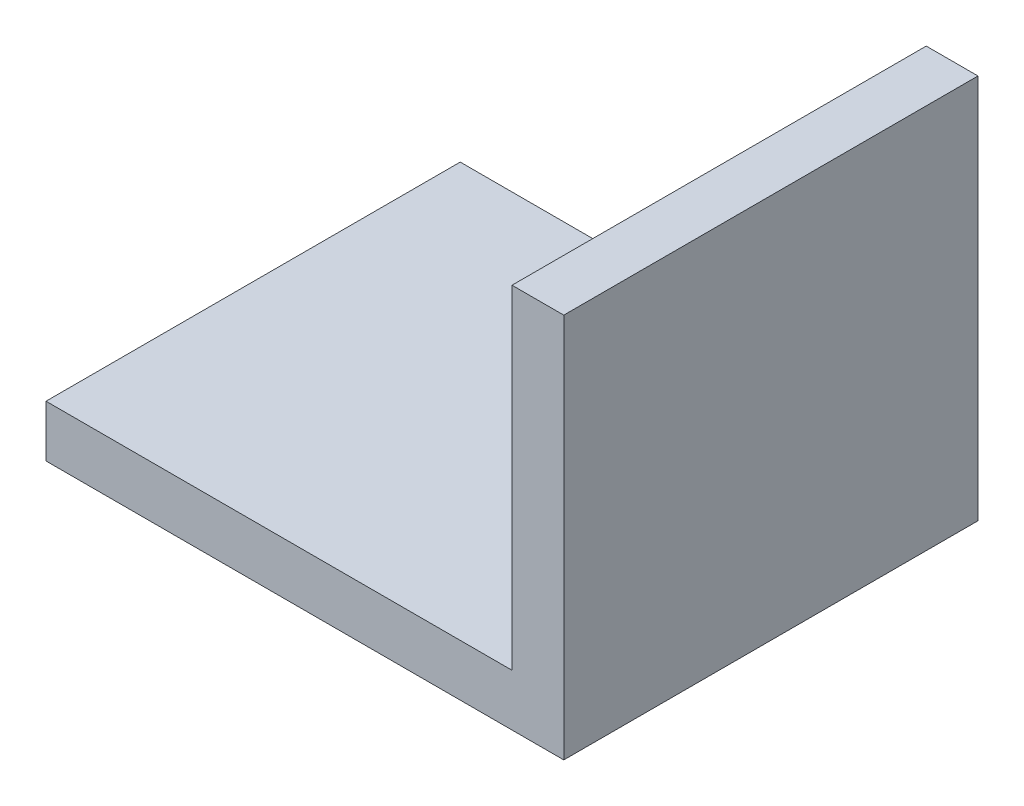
ISO-10303-21;
HEADER;
FILE_DESCRIPTION(('STEP AP214'),'2;1');
FILE_NAME('part.step','',(''),(''),'','','');
FILE_SCHEMA(('AUTOMOTIVE_DESIGN { 1 0 10303 214 1 1 1 1 }'));
ENDSEC;
DATA;
#1=APPLICATION_CONTEXT('core data for automotive mechanical design processes');
#2=APPLICATION_PROTOCOL_DEFINITION('international standard','automotive_design',2000,#1);
#3=PRODUCT_CONTEXT('',#1,'mechanical');
#4=PRODUCT('Part','Part','',(#3));
#5=PRODUCT_RELATED_PRODUCT_CATEGORY('part','',(#4));
#6=PRODUCT_DEFINITION_FORMATION('','',#4);
#7=PRODUCT_DEFINITION_CONTEXT('part definition',#1,'design');
#8=PRODUCT_DEFINITION('design','',#6,#7);
#9=PRODUCT_DEFINITION_SHAPE('','',#8);
#10=(LENGTH_UNIT() NAMED_UNIT(*) SI_UNIT(.MILLI.,.METRE.));
#11=(NAMED_UNIT(*) PLANE_ANGLE_UNIT() SI_UNIT($,.RADIAN.));
#12=(NAMED_UNIT(*) SI_UNIT($,.STERADIAN.) SOLID_ANGLE_UNIT());
#13=UNCERTAINTY_MEASURE_WITH_UNIT(LENGTH_MEASURE(1.E-05),#10,'distance_accuracy_value','');
#14=(GEOMETRIC_REPRESENTATION_CONTEXT(3) GLOBAL_UNCERTAINTY_ASSIGNED_CONTEXT((#13)) GLOBAL_UNIT_ASSIGNED_CONTEXT((#10,
#11,#12)) REPRESENTATION_CONTEXT('',''));
#15=CARTESIAN_POINT('',(0.,0.,0.));
#16=DIRECTION('',(0.,0.,1.));
#17=DIRECTION('',(1.,0.,0.));
#18=AXIS2_PLACEMENT_3D('',#15,#16,#17);
#19=CARTESIAN_POINT('',(254.,0.,203.2));
#20=DIRECTION('',(0.,1.,0.));
#21=DIRECTION('',(0.,0.,1.));
#22=AXIS2_PLACEMENT_3D('',#19,#20,#21);
#23=PLANE('',#22);
#24=DIRECTION('',(1.,0.,0.));
#25=VECTOR('',#24,1.);
#26=CARTESIAN_POINT('',(254.,0.,0.));
#27=LINE('',#26,#25);
#28=CARTESIAN_POINT('',(0.,0.,0.));
#29=VERTEX_POINT('',#28);
#30=CARTESIAN_POINT('',(254.,0.,0.));
#31=VERTEX_POINT('',#30);
#32=EDGE_CURVE('E116',#29,#31,#27,.T.);
#33=ORIENTED_EDGE('',*,*,#32,.T.);
#34=DIRECTION('',(0.,0.,-1.));
#35=VECTOR('',#34,1.);
#36=CARTESIAN_POINT('',(254.,0.,203.2));
#37=LINE('',#36,#35);
#38=CARTESIAN_POINT('',(254.,0.,203.2));
#39=VERTEX_POINT('',#38);
#40=EDGE_CURVE('E11',#39,#31,#37,.T.);
#41=ORIENTED_EDGE('',*,*,#40,.F.);
#42=DIRECTION('',(1.,0.,0.));
#43=VECTOR('',#42,1.);
#44=CARTESIAN_POINT('',(254.,0.,203.2));
#45=LINE('',#44,#43);
#46=CARTESIAN_POINT('',(0.,0.,203.2));
#47=VERTEX_POINT('',#46);
#48=EDGE_CURVE('E126',#47,#39,#45,.T.);
#49=ORIENTED_EDGE('',*,*,#48,.F.);
#50=DIRECTION('',(0.,0.,-1.));
#51=VECTOR('',#50,1.);
#52=CARTESIAN_POINT('',(0.,0.,203.2));
#53=LINE('',#52,#51);
#54=EDGE_CURVE('E112',#47,#29,#53,.T.);
#55=ORIENTED_EDGE('',*,*,#54,.T.);
#56=EDGE_LOOP('',(#33,#41,#49,#55));
#57=FACE_BOUND('',#56,.T.);
#58=ADVANCED_FACE('F32',(#57),#23,.F.);
#59=CARTESIAN_POINT('',(254.,188.976,203.2));
#60=DIRECTION('',(-1.,0.,0.));
#61=DIRECTION('',(0.,0.,1.));
#62=AXIS2_PLACEMENT_3D('',#59,#60,#61);
#63=PLANE('',#62);
#64=DIRECTION('',(0.,1.,0.));
#65=VECTOR('',#64,1.);
#66=CARTESIAN_POINT('',(254.,188.976,0.));
#67=LINE('',#66,#65);
#68=CARTESIAN_POINT('',(254.,188.976,0.));
#69=VERTEX_POINT('',#68);
#70=EDGE_CURVE('E119',#31,#69,#67,.T.);
#71=ORIENTED_EDGE('',*,*,#70,.T.);
#72=DIRECTION('',(0.,0.,-1.));
#73=VECTOR('',#72,1.);
#74=CARTESIAN_POINT('',(254.,188.976,203.2));
#75=LINE('',#74,#73);
#76=CARTESIAN_POINT('',(254.,188.976,203.2));
#77=VERTEX_POINT('',#76);
#78=EDGE_CURVE('E40',#77,#69,#75,.T.);
#79=ORIENTED_EDGE('',*,*,#78,.F.);
#80=DIRECTION('',(0.,1.,0.));
#81=VECTOR('',#80,1.);
#82=CARTESIAN_POINT('',(254.,188.976,203.2));
#83=LINE('',#82,#81);
#84=EDGE_CURVE('E85',#39,#77,#83,.T.);
#85=ORIENTED_EDGE('',*,*,#84,.F.);
#86=ORIENTED_EDGE('',*,*,#40,.T.);
#87=EDGE_LOOP('',(#71,#79,#85,#86));
#88=FACE_BOUND('',#87,.T.);
#89=ADVANCED_FACE('F150',(#88),#63,.F.);
#90=CARTESIAN_POINT('',(228.6,188.976,203.2));
#91=DIRECTION('',(0.,-1.,0.));
#92=DIRECTION('',(0.,0.,-1.));
#93=AXIS2_PLACEMENT_3D('',#90,#91,#92);
#94=PLANE('',#93);
#95=DIRECTION('',(-1.,0.,0.));
#96=VECTOR('',#95,1.);
#97=CARTESIAN_POINT('',(228.6,188.976,0.));
#98=LINE('',#97,#96);
#99=CARTESIAN_POINT('',(228.6,188.976,0.));
#100=VERTEX_POINT('',#99);
#101=EDGE_CURVE('E121',#69,#100,#98,.T.);
#102=ORIENTED_EDGE('',*,*,#101,.T.);
#103=DIRECTION('',(0.,0.,-1.));
#104=VECTOR('',#103,1.);
#105=CARTESIAN_POINT('',(228.6,188.976,203.2));
#106=LINE('',#105,#104);
#107=CARTESIAN_POINT('',(228.6,188.976,203.2));
#108=VERTEX_POINT('',#107);
#109=EDGE_CURVE('E107',#108,#100,#106,.T.);
#110=ORIENTED_EDGE('',*,*,#109,.F.);
#111=DIRECTION('',(-1.,0.,0.));
#112=VECTOR('',#111,1.);
#113=CARTESIAN_POINT('',(228.6,188.976,203.2));
#114=LINE('',#113,#112);
#115=EDGE_CURVE('E98',#77,#108,#114,.T.);
#116=ORIENTED_EDGE('',*,*,#115,.F.);
#117=ORIENTED_EDGE('',*,*,#78,.T.);
#118=EDGE_LOOP('',(#102,#110,#116,#117));
#119=FACE_BOUND('',#118,.T.);
#120=ADVANCED_FACE('F132',(#119),#94,.F.);
#121=CARTESIAN_POINT('',(228.6,25.4,203.2));
#122=DIRECTION('',(1.,0.,0.));
#123=DIRECTION('',(0.,0.,-1.));
#124=AXIS2_PLACEMENT_3D('',#121,#122,#123);
#125=PLANE('',#124);
#126=DIRECTION('',(0.,-1.,0.));
#127=VECTOR('',#126,1.);
#128=CARTESIAN_POINT('',(228.6,25.4,0.));
#129=LINE('',#128,#127);
#130=CARTESIAN_POINT('',(228.6,25.4,0.));
#131=VERTEX_POINT('',#130);
#132=EDGE_CURVE('E106',#100,#131,#129,.T.);
#133=ORIENTED_EDGE('',*,*,#132,.T.);
#134=DIRECTION('',(0.,0.,-1.));
#135=VECTOR('',#134,1.);
#136=CARTESIAN_POINT('',(228.6,25.4,203.2));
#137=LINE('',#136,#135);
#138=CARTESIAN_POINT('',(228.6,25.4,203.2));
#139=VERTEX_POINT('',#138);
#140=EDGE_CURVE('E103',#139,#131,#137,.T.);
#141=ORIENTED_EDGE('',*,*,#140,.F.);
#142=DIRECTION('',(0.,-1.,0.));
#143=VECTOR('',#142,1.);
#144=CARTESIAN_POINT('',(228.6,25.4,203.2));
#145=LINE('',#144,#143);
#146=EDGE_CURVE('E92',#108,#139,#145,.T.);
#147=ORIENTED_EDGE('',*,*,#146,.F.);
#148=ORIENTED_EDGE('',*,*,#109,.T.);
#149=EDGE_LOOP('',(#133,#141,#147,#148));
#150=FACE_BOUND('',#149,.T.);
#151=ADVANCED_FACE('F104',(#150),#125,.F.);
#152=CARTESIAN_POINT('',(0.,25.4,203.2));
#153=DIRECTION('',(0.,-1.,0.));
#154=DIRECTION('',(0.,0.,-1.));
#155=AXIS2_PLACEMENT_3D('',#152,#153,#154);
#156=PLANE('',#155);
#157=DIRECTION('',(-1.,0.,0.));
#158=VECTOR('',#157,1.);
#159=CARTESIAN_POINT('',(0.,25.4,0.));
#160=LINE('',#159,#158);
#161=CARTESIAN_POINT('',(0.,25.4,0.));
#162=VERTEX_POINT('',#161);
#163=EDGE_CURVE('E71',#131,#162,#160,.T.);
#164=ORIENTED_EDGE('',*,*,#163,.T.);
#165=DIRECTION('',(0.,0.,-1.));
#166=VECTOR('',#165,1.);
#167=CARTESIAN_POINT('',(0.,25.4,203.2));
#168=LINE('',#167,#166);
#169=CARTESIAN_POINT('',(0.,25.4,203.2));
#170=VERTEX_POINT('',#169);
#171=EDGE_CURVE('E108',#170,#162,#168,.T.);
#172=ORIENTED_EDGE('',*,*,#171,.F.);
#173=DIRECTION('',(-1.,0.,0.));
#174=VECTOR('',#173,1.);
#175=CARTESIAN_POINT('',(0.,25.4,203.2));
#176=LINE('',#175,#174);
#177=EDGE_CURVE('E96',#139,#170,#176,.T.);
#178=ORIENTED_EDGE('',*,*,#177,.F.);
#179=ORIENTED_EDGE('',*,*,#140,.T.);
#180=EDGE_LOOP('',(#164,#172,#178,#179));
#181=FACE_BOUND('',#180,.T.);
#182=ADVANCED_FACE('F110',(#181),#156,.F.);
#183=CARTESIAN_POINT('',(0.,0.,203.2));
#184=DIRECTION('',(1.,0.,0.));
#185=DIRECTION('',(0.,0.,-1.));
#186=AXIS2_PLACEMENT_3D('',#183,#184,#185);
#187=PLANE('',#186);
#188=DIRECTION('',(0.,-1.,0.));
#189=VECTOR('',#188,1.);
#190=CARTESIAN_POINT('',(0.,0.,0.));
#191=LINE('',#190,#189);
#192=EDGE_CURVE('E77',#162,#29,#191,.T.);
#193=ORIENTED_EDGE('',*,*,#192,.T.);
#194=ORIENTED_EDGE('',*,*,#54,.F.);
#195=DIRECTION('',(0.,-1.,0.));
#196=VECTOR('',#195,1.);
#197=CARTESIAN_POINT('',(0.,0.,203.2));
#198=LINE('',#197,#196);
#199=EDGE_CURVE('E48',#170,#47,#198,.T.);
#200=ORIENTED_EDGE('',*,*,#199,.F.);
#201=ORIENTED_EDGE('',*,*,#171,.T.);
#202=EDGE_LOOP('',(#193,#194,#200,#201));
#203=FACE_BOUND('',#202,.T.);
#204=ADVANCED_FACE('F139',(#203),#187,.F.);
#205=CARTESIAN_POINT('',(0.,0.,203.2));
#206=DIRECTION('',(0.,0.,-1.));
#207=DIRECTION('',(-1.,0.,0.));
#208=AXIS2_PLACEMENT_3D('',#205,#206,#207);
#209=PLANE('',#208);
#210=ORIENTED_EDGE('',*,*,#48,.T.);
#211=ORIENTED_EDGE('',*,*,#84,.T.);
#212=ORIENTED_EDGE('',*,*,#115,.T.);
#213=ORIENTED_EDGE('',*,*,#146,.T.);
#214=ORIENTED_EDGE('',*,*,#177,.T.);
#215=ORIENTED_EDGE('',*,*,#199,.T.);
#216=EDGE_LOOP('',(#210,#211,#212,#213,#214,#215));
#217=FACE_BOUND('',#216,.T.);
#218=ADVANCED_FACE('F94',(#217),#209,.F.);
#219=CARTESIAN_POINT('',(0.,0.,0.));
#220=DIRECTION('',(0.,0.,-1.));
#221=DIRECTION('',(-1.,0.,0.));
#222=AXIS2_PLACEMENT_3D('',#219,#220,#221);
#223=PLANE('',#222);
#224=ORIENTED_EDGE('',*,*,#32,.F.);
#225=ORIENTED_EDGE('',*,*,#192,.F.);
#226=ORIENTED_EDGE('',*,*,#163,.F.);
#227=ORIENTED_EDGE('',*,*,#132,.F.);
#228=ORIENTED_EDGE('',*,*,#101,.F.);
#229=ORIENTED_EDGE('',*,*,#70,.F.);
#230=EDGE_LOOP('',(#224,#225,#226,#227,#228,#229));
#231=FACE_BOUND('',#230,.T.);
#232=ADVANCED_FACE('F135',(#231),#223,.T.);
#233=CLOSED_SHELL('',(#58,#89,#120,#151,#182,#204,#218,#232));
#234=MANIFOLD_SOLID_BREP('B2',#233);
#235=ADVANCED_BREP_SHAPE_REPRESENTATION('',(#18,#234),#14);
#236=SHAPE_DEFINITION_REPRESENTATION(#9,#235);
ENDSEC;
END-ISO-10303-21;
